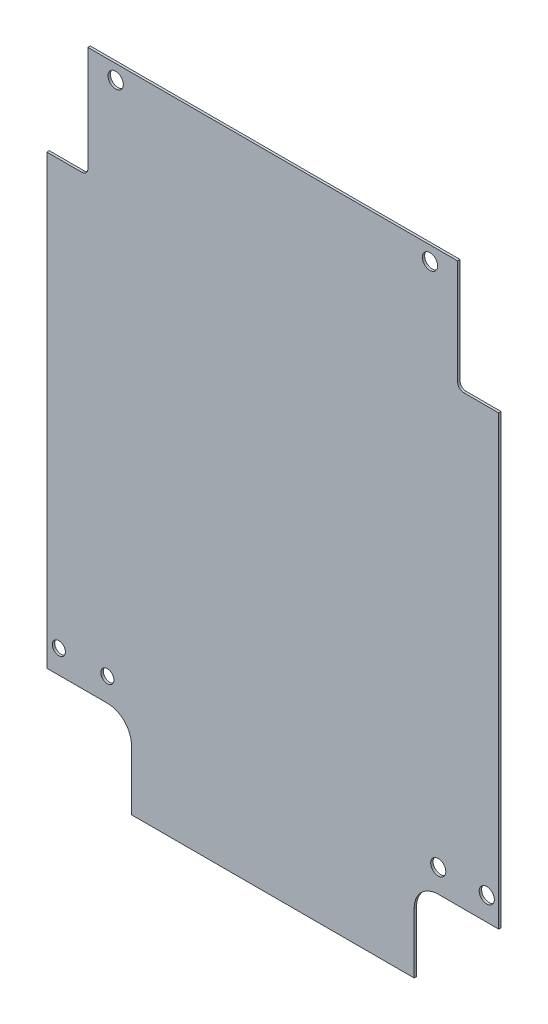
ISO-10303-21;
HEADER;
FILE_DESCRIPTION(('STEP AP214'),'2;1');
FILE_NAME('part.step','',(''),(''),'','','');
FILE_SCHEMA(('AUTOMOTIVE_DESIGN { 1 0 10303 214 1 1 1 1 }'));
ENDSEC;
DATA;
#1=APPLICATION_CONTEXT('core data for automotive mechanical design processes');
#2=APPLICATION_PROTOCOL_DEFINITION('international standard','automotive_design',2000,#1);
#3=PRODUCT_CONTEXT('',#1,'mechanical');
#4=PRODUCT('Part','Part','',(#3));
#5=PRODUCT_RELATED_PRODUCT_CATEGORY('part','',(#4));
#6=PRODUCT_DEFINITION_FORMATION('','',#4);
#7=PRODUCT_DEFINITION_CONTEXT('part definition',#1,'design');
#8=PRODUCT_DEFINITION('design','',#6,#7);
#9=PRODUCT_DEFINITION_SHAPE('','',#8);
#10=(LENGTH_UNIT() NAMED_UNIT(*) SI_UNIT(.MILLI.,.METRE.));
#11=(NAMED_UNIT(*) PLANE_ANGLE_UNIT() SI_UNIT($,.RADIAN.));
#12=(NAMED_UNIT(*) SI_UNIT($,.STERADIAN.) SOLID_ANGLE_UNIT());
#13=UNCERTAINTY_MEASURE_WITH_UNIT(LENGTH_MEASURE(1.E-05),#10,'distance_accuracy_value','');
#14=(GEOMETRIC_REPRESENTATION_CONTEXT(3) GLOBAL_UNCERTAINTY_ASSIGNED_CONTEXT((#13)) GLOBAL_UNIT_ASSIGNED_CONTEXT((#10,
#11,#12)) REPRESENTATION_CONTEXT('',''));
#15=CARTESIAN_POINT('',(0.,0.,0.));
#16=DIRECTION('',(0.,0.,1.));
#17=DIRECTION('',(1.,0.,0.));
#18=AXIS2_PLACEMENT_3D('',#15,#16,#17);
#19=CARTESIAN_POINT('',(79.022,-17.46,1.));
#20=DIRECTION('',(0.,0.,1.));
#21=DIRECTION('',(1.,0.,0.));
#22=AXIS2_PLACEMENT_3D('',#19,#20,#21);
#23=PLANE('',#22);
#24=CARTESIAN_POINT('',(88.5373476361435,-195.335160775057,1.));
#25=DIRECTION('',(0.,0.,1.));
#26=DIRECTION('',(1.,0.,0.));
#27=AXIS2_PLACEMENT_3D('',#24,#25,#26);
#28=CIRCLE('',#27,3.125);
#29=CARTESIAN_POINT('',(91.6623476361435,-195.335160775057,1.));
#30=VERTEX_POINT('',#29);
#31=EDGE_CURVE('E390',#30,#30,#28,.T.);
#32=ORIENTED_EDGE('',*,*,#31,.F.);
#33=EDGE_LOOP('',(#32));
#34=FACE_BOUND('',#33,.T.);
#35=CARTESIAN_POINT('',(-65.0266,20.0200000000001,1.));
#36=DIRECTION('',(0.,0.,1.));
#37=DIRECTION('',(1.,0.,0.));
#38=AXIS2_PLACEMENT_3D('',#35,#36,#37);
#39=CIRCLE('',#38,3.175);
#40=CARTESIAN_POINT('',(-61.8516,20.0200000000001,1.));
#41=VERTEX_POINT('',#40);
#42=EDGE_CURVE('E402',#41,#41,#39,.T.);
#43=ORIENTED_EDGE('',*,*,#42,.F.);
#44=EDGE_LOOP('',(#43));
#45=FACE_BOUND('',#44,.T.);
#46=CARTESIAN_POINT('',(-88.5373476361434,-195.335160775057,1.));
#47=DIRECTION('',(0.,0.,1.));
#48=DIRECTION('',(1.,0.,0.));
#49=AXIS2_PLACEMENT_3D('',#46,#47,#48);
#50=CIRCLE('',#49,2.7);
#51=CARTESIAN_POINT('',(-85.8373476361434,-195.335160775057,1.));
#52=VERTEX_POINT('',#51);
#53=EDGE_CURVE('E168',#52,#52,#50,.T.);
#54=ORIENTED_EDGE('',*,*,#53,.F.);
#55=EDGE_LOOP('',(#54));
#56=FACE_BOUND('',#55,.T.);
#57=CARTESIAN_POINT('',(79.022,-17.46,1.));
#58=DIRECTION('',(0.,0.,-1.));
#59=DIRECTION('',(1.,0.,0.));
#60=AXIS2_PLACEMENT_3D('',#57,#58,#59);
#61=CIRCLE('',#60,2.54000000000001);
#62=CARTESIAN_POINT('',(79.022,-20.,1.));
#63=VERTEX_POINT('',#62);
#64=CARTESIAN_POINT('',(76.482,-17.46,1.));
#65=VERTEX_POINT('',#64);
#66=EDGE_CURVE('E202',#63,#65,#61,.T.);
#67=ORIENTED_EDGE('',*,*,#66,.T.);
#68=DIRECTION('',(0.,1.,0.));
#69=VECTOR('',#68,1.);
#70=CARTESIAN_POINT('',(76.482,-17.46,1.));
#71=LINE('',#70,#69);
#72=CARTESIAN_POINT('',(76.482,26.,1.));
#73=VERTEX_POINT('',#72);
#74=EDGE_CURVE('E163',#65,#73,#71,.T.);
#75=ORIENTED_EDGE('',*,*,#74,.T.);
#76=DIRECTION('',(-1.,0.,0.));
#77=VECTOR('',#76,1.);
#78=CARTESIAN_POINT('',(76.482,26.,1.));
#79=LINE('',#78,#77);
#80=CARTESIAN_POINT('',(-76.5,26.,1.));
#81=VERTEX_POINT('',#80);
#82=EDGE_CURVE('E205',#73,#81,#79,.T.);
#83=ORIENTED_EDGE('',*,*,#82,.T.);
#84=DIRECTION('',(0.,-1.,0.));
#85=VECTOR('',#84,1.);
#86=CARTESIAN_POINT('',(-76.5,26.,1.));
#87=LINE('',#86,#85);
#88=CARTESIAN_POINT('',(-76.5,-17.46,1.));
#89=VERTEX_POINT('',#88);
#90=EDGE_CURVE('E207',#81,#89,#87,.T.);
#91=ORIENTED_EDGE('',*,*,#90,.T.);
#92=CARTESIAN_POINT('',(-79.04,-17.46,1.));
#93=DIRECTION('',(0.,0.,-1.));
#94=DIRECTION('',(1.,0.,0.));
#95=AXIS2_PLACEMENT_3D('',#92,#93,#94);
#96=CIRCLE('',#95,2.54);
#97=CARTESIAN_POINT('',(-79.04,-20.,1.));
#98=VERTEX_POINT('',#97);
#99=EDGE_CURVE('E209',#89,#98,#96,.T.);
#100=ORIENTED_EDGE('',*,*,#99,.T.);
#101=DIRECTION('',(-1.,0.,0.));
#102=VECTOR('',#101,1.);
#103=CARTESIAN_POINT('',(-79.04,-20.,1.));
#104=LINE('',#103,#102);
#105=CARTESIAN_POINT('',(-93.4999999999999,-20.,1.));
#106=VERTEX_POINT('',#105);
#107=EDGE_CURVE('E211',#98,#106,#104,.T.);
#108=ORIENTED_EDGE('',*,*,#107,.T.);
#109=DIRECTION('',(0.,-1.,0.));
#110=VECTOR('',#109,1.);
#111=CARTESIAN_POINT('',(-93.4999999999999,-20.,1.));
#112=LINE('',#111,#110);
#113=CARTESIAN_POINT('',(-93.4999999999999,-205.,1.));
#114=VERTEX_POINT('',#113);
#115=EDGE_CURVE('E213',#106,#114,#112,.T.);
#116=ORIENTED_EDGE('',*,*,#115,.T.);
#117=DIRECTION('',(1.,0.,0.));
#118=VECTOR('',#117,1.);
#119=CARTESIAN_POINT('',(-93.4999999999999,-205.,1.));
#120=LINE('',#119,#118);
#121=CARTESIAN_POINT('',(-68.4999999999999,-205.,1.));
#122=VERTEX_POINT('',#121);
#123=EDGE_CURVE('E215',#114,#122,#120,.T.);
#124=ORIENTED_EDGE('',*,*,#123,.T.);
#125=CARTESIAN_POINT('',(-68.4999999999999,-215.,1.));
#126=DIRECTION('',(0.,0.,-1.));
#127=DIRECTION('',(1.,0.,0.));
#128=AXIS2_PLACEMENT_3D('',#125,#126,#127);
#129=CIRCLE('',#128,10.);
#130=CARTESIAN_POINT('',(-58.4999999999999,-215.,1.));
#131=VERTEX_POINT('',#130);
#132=EDGE_CURVE('E217',#122,#131,#129,.T.);
#133=ORIENTED_EDGE('',*,*,#132,.T.);
#134=DIRECTION('',(0.,-1.,0.));
#135=VECTOR('',#134,1.);
#136=CARTESIAN_POINT('',(-58.4999999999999,-215.,1.));
#137=LINE('',#136,#135);
#138=CARTESIAN_POINT('',(-58.4999999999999,-240.,1.));
#139=VERTEX_POINT('',#138);
#140=EDGE_CURVE('E219',#131,#139,#137,.T.);
#141=ORIENTED_EDGE('',*,*,#140,.T.);
#142=DIRECTION('',(1.,0.,0.));
#143=VECTOR('',#142,1.);
#144=CARTESIAN_POINT('',(-58.4999999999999,-240.,1.));
#145=LINE('',#144,#143);
#146=CARTESIAN_POINT('',(58.5,-240.,1.));
#147=VERTEX_POINT('',#146);
#148=EDGE_CURVE('E221',#139,#147,#145,.T.);
#149=ORIENTED_EDGE('',*,*,#148,.T.);
#150=DIRECTION('',(0.,1.,0.));
#151=VECTOR('',#150,1.);
#152=CARTESIAN_POINT('',(58.5,-240.,1.));
#153=LINE('',#152,#151);
#154=CARTESIAN_POINT('',(58.5,-215.,1.));
#155=VERTEX_POINT('',#154);
#156=EDGE_CURVE('E223',#147,#155,#153,.T.);
#157=ORIENTED_EDGE('',*,*,#156,.T.);
#158=CARTESIAN_POINT('',(68.5,-215.,1.));
#159=DIRECTION('',(0.,0.,-1.));
#160=DIRECTION('',(1.,0.,0.));
#161=AXIS2_PLACEMENT_3D('',#158,#159,#160);
#162=CIRCLE('',#161,9.99999999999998);
#163=CARTESIAN_POINT('',(68.5,-205.,1.));
#164=VERTEX_POINT('',#163);
#165=EDGE_CURVE('E225',#155,#164,#162,.T.);
#166=ORIENTED_EDGE('',*,*,#165,.T.);
#167=DIRECTION('',(1.,0.,0.));
#168=VECTOR('',#167,1.);
#169=CARTESIAN_POINT('',(68.5,-205.,1.));
#170=LINE('',#169,#168);
#171=CARTESIAN_POINT('',(93.5,-205.,1.));
#172=VERTEX_POINT('',#171);
#173=EDGE_CURVE('E227',#164,#172,#170,.T.);
#174=ORIENTED_EDGE('',*,*,#173,.T.);
#175=DIRECTION('',(0.,1.,0.));
#176=VECTOR('',#175,1.);
#177=CARTESIAN_POINT('',(93.5,-205.,1.));
#178=LINE('',#177,#176);
#179=CARTESIAN_POINT('',(93.5,-20.,1.));
#180=VERTEX_POINT('',#179);
#181=EDGE_CURVE('E56',#172,#180,#178,.T.);
#182=ORIENTED_EDGE('',*,*,#181,.T.);
#183=DIRECTION('',(-1.,0.,0.));
#184=VECTOR('',#183,1.);
#185=CARTESIAN_POINT('',(93.5,-20.,1.));
#186=LINE('',#185,#184);
#187=EDGE_CURVE('E51',#180,#63,#186,.T.);
#188=ORIENTED_EDGE('',*,*,#187,.T.);
#189=EDGE_LOOP('',(#67,#75,#83,#91,#100,#108,#116,#124,#133,#141,#149,#157,#166,#174,#182,#188));
#190=FACE_BOUND('',#189,.T.);
#191=CARTESIAN_POINT('',(-68.4621723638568,-195.335160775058,1.));
#192=DIRECTION('',(0.,0.,1.));
#193=DIRECTION('',(1.,0.,0.));
#194=AXIS2_PLACEMENT_3D('',#191,#192,#193);
#195=CIRCLE('',#194,2.7);
#196=CARTESIAN_POINT('',(-65.7621723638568,-195.335160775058,1.));
#197=VERTEX_POINT('',#196);
#198=EDGE_CURVE('E408',#197,#197,#195,.T.);
#199=ORIENTED_EDGE('',*,*,#198,.F.);
#200=EDGE_LOOP('',(#199));
#201=FACE_BOUND('',#200,.T.);
#202=CARTESIAN_POINT('',(65.0266,20.0200000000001,1.));
#203=DIRECTION('',(0.,0.,1.));
#204=DIRECTION('',(1.,0.,0.));
#205=AXIS2_PLACEMENT_3D('',#202,#203,#204);
#206=CIRCLE('',#205,3.175);
#207=CARTESIAN_POINT('',(68.2016,20.0200000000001,1.));
#208=VERTEX_POINT('',#207);
#209=EDGE_CURVE('E396',#208,#208,#206,.T.);
#210=ORIENTED_EDGE('',*,*,#209,.F.);
#211=EDGE_LOOP('',(#210));
#212=FACE_BOUND('',#211,.T.);
#213=CARTESIAN_POINT('',(68.4621723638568,-195.335160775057,1.));
#214=DIRECTION('',(0.,0.,1.));
#215=DIRECTION('',(1.,0.,0.));
#216=AXIS2_PLACEMENT_3D('',#213,#214,#215);
#217=CIRCLE('',#216,3.125);
#218=CARTESIAN_POINT('',(71.5871723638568,-195.335160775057,1.));
#219=VERTEX_POINT('',#218);
#220=EDGE_CURVE('E379',#219,#219,#217,.T.);
#221=ORIENTED_EDGE('',*,*,#220,.F.);
#222=EDGE_LOOP('',(#221));
#223=FACE_BOUND('',#222,.T.);
#224=ADVANCED_FACE('F36',(#34,#45,#56,#190,#201,#212,#223),#23,.T.);
#225=CARTESIAN_POINT('',(79.022,-17.46,0.));
#226=DIRECTION('',(0.,0.,1.));
#227=DIRECTION('',(1.,0.,0.));
#228=AXIS2_PLACEMENT_3D('',#225,#226,#227);
#229=PLANE('',#228);
#230=CARTESIAN_POINT('',(88.5373476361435,-195.335160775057,0.));
#231=DIRECTION('',(0.,0.,1.));
#232=DIRECTION('',(1.,0.,0.));
#233=AXIS2_PLACEMENT_3D('',#230,#231,#232);
#234=CIRCLE('',#233,3.125);
#235=CARTESIAN_POINT('',(91.6623476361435,-195.335160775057,0.));
#236=VERTEX_POINT('',#235);
#237=EDGE_CURVE('E385',#236,#236,#234,.T.);
#238=ORIENTED_EDGE('',*,*,#237,.T.);
#239=EDGE_LOOP('',(#238));
#240=FACE_BOUND('',#239,.T.);
#241=CARTESIAN_POINT('',(-65.0266,20.0200000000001,0.));
#242=DIRECTION('',(0.,0.,1.));
#243=DIRECTION('',(1.,0.,0.));
#244=AXIS2_PLACEMENT_3D('',#241,#242,#243);
#245=CIRCLE('',#244,3.175);
#246=CARTESIAN_POINT('',(-61.8516,20.0200000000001,0.));
#247=VERTEX_POINT('',#246);
#248=EDGE_CURVE('E399',#247,#247,#245,.T.);
#249=ORIENTED_EDGE('',*,*,#248,.T.);
#250=EDGE_LOOP('',(#249));
#251=FACE_BOUND('',#250,.T.);
#252=CARTESIAN_POINT('',(-88.5373476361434,-195.335160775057,0.));
#253=DIRECTION('',(0.,0.,1.));
#254=DIRECTION('',(1.,0.,0.));
#255=AXIS2_PLACEMENT_3D('',#252,#253,#254);
#256=CIRCLE('',#255,2.7);
#257=CARTESIAN_POINT('',(-85.8373476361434,-195.335160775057,0.));
#258=VERTEX_POINT('',#257);
#259=EDGE_CURVE('E171',#258,#258,#256,.T.);
#260=ORIENTED_EDGE('',*,*,#259,.T.);
#261=EDGE_LOOP('',(#260));
#262=FACE_BOUND('',#261,.T.);
#263=CARTESIAN_POINT('',(79.022,-17.46,0.));
#264=DIRECTION('',(0.,0.,-1.));
#265=DIRECTION('',(1.,0.,0.));
#266=AXIS2_PLACEMENT_3D('',#263,#264,#265);
#267=CIRCLE('',#266,2.54000000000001);
#268=CARTESIAN_POINT('',(79.022,-20.,0.));
#269=VERTEX_POINT('',#268);
#270=CARTESIAN_POINT('',(76.482,-17.46,0.));
#271=VERTEX_POINT('',#270);
#272=EDGE_CURVE('E154',#269,#271,#267,.T.);
#273=ORIENTED_EDGE('',*,*,#272,.F.);
#274=DIRECTION('',(-1.,0.,0.));
#275=VECTOR('',#274,1.);
#276=CARTESIAN_POINT('',(93.5,-20.,0.));
#277=LINE('',#276,#275);
#278=CARTESIAN_POINT('',(93.5,-20.,0.));
#279=VERTEX_POINT('',#278);
#280=EDGE_CURVE('E200',#279,#269,#277,.T.);
#281=ORIENTED_EDGE('',*,*,#280,.F.);
#282=DIRECTION('',(0.,1.,0.));
#283=VECTOR('',#282,1.);
#284=CARTESIAN_POINT('',(93.5,-205.,0.));
#285=LINE('',#284,#283);
#286=CARTESIAN_POINT('',(93.5,-205.,0.));
#287=VERTEX_POINT('',#286);
#288=EDGE_CURVE('E198',#287,#279,#285,.T.);
#289=ORIENTED_EDGE('',*,*,#288,.F.);
#290=DIRECTION('',(1.,0.,0.));
#291=VECTOR('',#290,1.);
#292=CARTESIAN_POINT('',(68.5,-205.,0.));
#293=LINE('',#292,#291);
#294=CARTESIAN_POINT('',(68.5,-205.,0.));
#295=VERTEX_POINT('',#294);
#296=EDGE_CURVE('E196',#295,#287,#293,.T.);
#297=ORIENTED_EDGE('',*,*,#296,.F.);
#298=CARTESIAN_POINT('',(68.5,-215.,0.));
#299=DIRECTION('',(0.,0.,-1.));
#300=DIRECTION('',(1.,0.,0.));
#301=AXIS2_PLACEMENT_3D('',#298,#299,#300);
#302=CIRCLE('',#301,9.99999999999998);
#303=CARTESIAN_POINT('',(58.5,-215.,0.));
#304=VERTEX_POINT('',#303);
#305=EDGE_CURVE('E194',#304,#295,#302,.T.);
#306=ORIENTED_EDGE('',*,*,#305,.F.);
#307=DIRECTION('',(0.,1.,0.));
#308=VECTOR('',#307,1.);
#309=CARTESIAN_POINT('',(58.5,-240.,0.));
#310=LINE('',#309,#308);
#311=CARTESIAN_POINT('',(58.5,-240.,0.));
#312=VERTEX_POINT('',#311);
#313=EDGE_CURVE('E192',#312,#304,#310,.T.);
#314=ORIENTED_EDGE('',*,*,#313,.F.);
#315=DIRECTION('',(1.,0.,0.));
#316=VECTOR('',#315,1.);
#317=CARTESIAN_POINT('',(-58.4999999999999,-240.,0.));
#318=LINE('',#317,#316);
#319=CARTESIAN_POINT('',(-58.4999999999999,-240.,0.));
#320=VERTEX_POINT('',#319);
#321=EDGE_CURVE('E190',#320,#312,#318,.T.);
#322=ORIENTED_EDGE('',*,*,#321,.F.);
#323=DIRECTION('',(0.,-1.,0.));
#324=VECTOR('',#323,1.);
#325=CARTESIAN_POINT('',(-58.4999999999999,-215.,0.));
#326=LINE('',#325,#324);
#327=CARTESIAN_POINT('',(-58.4999999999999,-215.,0.));
#328=VERTEX_POINT('',#327);
#329=EDGE_CURVE('E188',#328,#320,#326,.T.);
#330=ORIENTED_EDGE('',*,*,#329,.F.);
#331=CARTESIAN_POINT('',(-68.4999999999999,-215.,0.));
#332=DIRECTION('',(0.,0.,-1.));
#333=DIRECTION('',(1.,0.,0.));
#334=AXIS2_PLACEMENT_3D('',#331,#332,#333);
#335=CIRCLE('',#334,10.);
#336=CARTESIAN_POINT('',(-68.4999999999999,-205.,0.));
#337=VERTEX_POINT('',#336);
#338=EDGE_CURVE('E186',#337,#328,#335,.T.);
#339=ORIENTED_EDGE('',*,*,#338,.F.);
#340=DIRECTION('',(1.,0.,0.));
#341=VECTOR('',#340,1.);
#342=CARTESIAN_POINT('',(-93.4999999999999,-205.,0.));
#343=LINE('',#342,#341);
#344=CARTESIAN_POINT('',(-93.4999999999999,-205.,0.));
#345=VERTEX_POINT('',#344);
#346=EDGE_CURVE('E184',#345,#337,#343,.T.);
#347=ORIENTED_EDGE('',*,*,#346,.F.);
#348=DIRECTION('',(0.,-1.,0.));
#349=VECTOR('',#348,1.);
#350=CARTESIAN_POINT('',(-93.4999999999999,-20.,0.));
#351=LINE('',#350,#349);
#352=CARTESIAN_POINT('',(-93.4999999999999,-20.,0.));
#353=VERTEX_POINT('',#352);
#354=EDGE_CURVE('E182',#353,#345,#351,.T.);
#355=ORIENTED_EDGE('',*,*,#354,.F.);
#356=DIRECTION('',(-1.,0.,0.));
#357=VECTOR('',#356,1.);
#358=CARTESIAN_POINT('',(-79.04,-20.,0.));
#359=LINE('',#358,#357);
#360=CARTESIAN_POINT('',(-79.04,-20.,0.));
#361=VERTEX_POINT('',#360);
#362=EDGE_CURVE('E180',#361,#353,#359,.T.);
#363=ORIENTED_EDGE('',*,*,#362,.F.);
#364=CARTESIAN_POINT('',(-79.04,-17.46,0.));
#365=DIRECTION('',(0.,0.,-1.));
#366=DIRECTION('',(1.,0.,0.));
#367=AXIS2_PLACEMENT_3D('',#364,#365,#366);
#368=CIRCLE('',#367,2.54);
#369=CARTESIAN_POINT('',(-76.5,-17.46,0.));
#370=VERTEX_POINT('',#369);
#371=EDGE_CURVE('E178',#370,#361,#368,.T.);
#372=ORIENTED_EDGE('',*,*,#371,.F.);
#373=DIRECTION('',(0.,-1.,0.));
#374=VECTOR('',#373,1.);
#375=CARTESIAN_POINT('',(-76.5,26.,0.));
#376=LINE('',#375,#374);
#377=CARTESIAN_POINT('',(-76.5,26.,0.));
#378=VERTEX_POINT('',#377);
#379=EDGE_CURVE('E176',#378,#370,#376,.T.);
#380=ORIENTED_EDGE('',*,*,#379,.F.);
#381=DIRECTION('',(-1.,0.,0.));
#382=VECTOR('',#381,1.);
#383=CARTESIAN_POINT('',(76.482,26.,0.));
#384=LINE('',#383,#382);
#385=CARTESIAN_POINT('',(76.482,26.,0.));
#386=VERTEX_POINT('',#385);
#387=EDGE_CURVE('E156',#386,#378,#384,.T.);
#388=ORIENTED_EDGE('',*,*,#387,.F.);
#389=DIRECTION('',(0.,1.,0.));
#390=VECTOR('',#389,1.);
#391=CARTESIAN_POINT('',(76.482,-17.46,0.));
#392=LINE('',#391,#390);
#393=EDGE_CURVE('E149',#271,#386,#392,.T.);
#394=ORIENTED_EDGE('',*,*,#393,.F.);
#395=EDGE_LOOP('',(#273,#281,#289,#297,#306,#314,#322,#330,#339,#347,#355,#363,#372,#380,#388,#394));
#396=FACE_BOUND('',#395,.T.);
#397=CARTESIAN_POINT('',(-68.4621723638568,-195.335160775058,0.));
#398=DIRECTION('',(0.,0.,1.));
#399=DIRECTION('',(1.,0.,0.));
#400=AXIS2_PLACEMENT_3D('',#397,#398,#399);
#401=CIRCLE('',#400,2.7);
#402=CARTESIAN_POINT('',(-65.7621723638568,-195.335160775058,0.));
#403=VERTEX_POINT('',#402);
#404=EDGE_CURVE('E405',#403,#403,#401,.T.);
#405=ORIENTED_EDGE('',*,*,#404,.T.);
#406=EDGE_LOOP('',(#405));
#407=FACE_BOUND('',#406,.T.);
#408=CARTESIAN_POINT('',(65.0266,20.0200000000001,0.));
#409=DIRECTION('',(0.,0.,1.));
#410=DIRECTION('',(1.,0.,0.));
#411=AXIS2_PLACEMENT_3D('',#408,#409,#410);
#412=CIRCLE('',#411,3.175);
#413=CARTESIAN_POINT('',(68.2016,20.0200000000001,0.));
#414=VERTEX_POINT('',#413);
#415=EDGE_CURVE('E393',#414,#414,#412,.T.);
#416=ORIENTED_EDGE('',*,*,#415,.T.);
#417=EDGE_LOOP('',(#416));
#418=FACE_BOUND('',#417,.T.);
#419=CARTESIAN_POINT('',(68.4621723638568,-195.335160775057,0.));
#420=DIRECTION('',(0.,0.,1.));
#421=DIRECTION('',(1.,0.,0.));
#422=AXIS2_PLACEMENT_3D('',#419,#420,#421);
#423=CIRCLE('',#422,3.125);
#424=CARTESIAN_POINT('',(71.5871723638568,-195.335160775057,0.));
#425=VERTEX_POINT('',#424);
#426=EDGE_CURVE('E382',#425,#425,#423,.T.);
#427=ORIENTED_EDGE('',*,*,#426,.T.);
#428=EDGE_LOOP('',(#427));
#429=FACE_BOUND('',#428,.T.);
#430=ADVANCED_FACE('F150',(#240,#251,#262,#396,#407,#418,#429),#229,.F.);
#431=CARTESIAN_POINT('',(79.022,-17.46,1.));
#432=DIRECTION('',(0.,0.,-1.));
#433=DIRECTION('',(-1.,0.,0.));
#434=AXIS2_PLACEMENT_3D('',#431,#432,#433);
#435=CYLINDRICAL_SURFACE('',#434,2.54000000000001);
#436=ORIENTED_EDGE('',*,*,#272,.T.);
#437=DIRECTION('',(0.,0.,-1.));
#438=VECTOR('',#437,1.);
#439=CARTESIAN_POINT('',(76.482,-17.46,1.));
#440=LINE('',#439,#438);
#441=EDGE_CURVE('E11',#65,#271,#440,.T.);
#442=ORIENTED_EDGE('',*,*,#441,.F.);
#443=ORIENTED_EDGE('',*,*,#66,.F.);
#444=DIRECTION('',(0.,0.,-1.));
#445=VECTOR('',#444,1.);
#446=CARTESIAN_POINT('',(79.022,-20.,1.));
#447=LINE('',#446,#445);
#448=EDGE_CURVE('E167',#63,#269,#447,.T.);
#449=ORIENTED_EDGE('',*,*,#448,.T.);
#450=EDGE_LOOP('',(#436,#442,#443,#449));
#451=FACE_BOUND('',#450,.T.);
#452=ADVANCED_FACE('F38',(#451),#435,.F.);
#453=CARTESIAN_POINT('',(76.482,-17.46,1.));
#454=DIRECTION('',(-1.,0.,0.));
#455=DIRECTION('',(0.,-1.,0.));
#456=AXIS2_PLACEMENT_3D('',#453,#454,#455);
#457=PLANE('',#456);
#458=ORIENTED_EDGE('',*,*,#393,.T.);
#459=DIRECTION('',(0.,0.,-1.));
#460=VECTOR('',#459,1.);
#461=CARTESIAN_POINT('',(76.482,26.,1.));
#462=LINE('',#461,#460);
#463=EDGE_CURVE('E44',#73,#386,#462,.T.);
#464=ORIENTED_EDGE('',*,*,#463,.F.);
#465=ORIENTED_EDGE('',*,*,#74,.F.);
#466=ORIENTED_EDGE('',*,*,#441,.T.);
#467=EDGE_LOOP('',(#458,#464,#465,#466));
#468=FACE_BOUND('',#467,.T.);
#469=ADVANCED_FACE('F162',(#468),#457,.F.);
#470=CARTESIAN_POINT('',(76.482,26.,1.));
#471=DIRECTION('',(0.,-1.,0.));
#472=DIRECTION('',(1.,0.,0.));
#473=AXIS2_PLACEMENT_3D('',#470,#471,#472);
#474=PLANE('',#473);
#475=ORIENTED_EDGE('',*,*,#387,.T.);
#476=DIRECTION('',(0.,0.,-1.));
#477=VECTOR('',#476,1.);
#478=CARTESIAN_POINT('',(-76.5,26.,1.));
#479=LINE('',#478,#477);
#480=EDGE_CURVE('E268',#81,#378,#479,.T.);
#481=ORIENTED_EDGE('',*,*,#480,.F.);
#482=ORIENTED_EDGE('',*,*,#82,.F.);
#483=ORIENTED_EDGE('',*,*,#463,.T.);
#484=EDGE_LOOP('',(#475,#481,#482,#483));
#485=FACE_BOUND('',#484,.T.);
#486=ADVANCED_FACE('F272',(#485),#474,.F.);
#487=CARTESIAN_POINT('',(-76.5,26.,1.));
#488=DIRECTION('',(1.,0.,0.));
#489=DIRECTION('',(0.,0.,-1.));
#490=AXIS2_PLACEMENT_3D('',#487,#488,#489);
#491=PLANE('',#490);
#492=ORIENTED_EDGE('',*,*,#379,.T.);
#493=DIRECTION('',(0.,0.,-1.));
#494=VECTOR('',#493,1.);
#495=CARTESIAN_POINT('',(-76.5,-17.46,1.));
#496=LINE('',#495,#494);
#497=EDGE_CURVE('E265',#89,#370,#496,.T.);
#498=ORIENTED_EDGE('',*,*,#497,.F.);
#499=ORIENTED_EDGE('',*,*,#90,.F.);
#500=ORIENTED_EDGE('',*,*,#480,.T.);
#501=EDGE_LOOP('',(#492,#498,#499,#500));
#502=FACE_BOUND('',#501,.T.);
#503=ADVANCED_FACE('F280',(#502),#491,.F.);
#504=CARTESIAN_POINT('',(-79.04,-17.46,1.));
#505=DIRECTION('',(0.,0.,-1.));
#506=DIRECTION('',(-1.,0.,0.));
#507=AXIS2_PLACEMENT_3D('',#504,#505,#506);
#508=CYLINDRICAL_SURFACE('',#507,2.54);
#509=ORIENTED_EDGE('',*,*,#371,.T.);
#510=DIRECTION('',(0.,0.,-1.));
#511=VECTOR('',#510,1.);
#512=CARTESIAN_POINT('',(-79.04,-20.,1.));
#513=LINE('',#512,#511);
#514=EDGE_CURVE('E262',#98,#361,#513,.T.);
#515=ORIENTED_EDGE('',*,*,#514,.F.);
#516=ORIENTED_EDGE('',*,*,#99,.F.);
#517=ORIENTED_EDGE('',*,*,#497,.T.);
#518=EDGE_LOOP('',(#509,#515,#516,#517));
#519=FACE_BOUND('',#518,.T.);
#520=ADVANCED_FACE('F283',(#519),#508,.F.);
#521=CARTESIAN_POINT('',(-79.04,-20.,1.));
#522=DIRECTION('',(0.,-1.,0.));
#523=DIRECTION('',(1.,0.,0.));
#524=AXIS2_PLACEMENT_3D('',#521,#522,#523);
#525=PLANE('',#524);
#526=ORIENTED_EDGE('',*,*,#362,.T.);
#527=DIRECTION('',(0.,0.,-1.));
#528=VECTOR('',#527,1.);
#529=CARTESIAN_POINT('',(-93.4999999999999,-20.,1.));
#530=LINE('',#529,#528);
#531=EDGE_CURVE('E259',#106,#353,#530,.T.);
#532=ORIENTED_EDGE('',*,*,#531,.F.);
#533=ORIENTED_EDGE('',*,*,#107,.F.);
#534=ORIENTED_EDGE('',*,*,#514,.T.);
#535=EDGE_LOOP('',(#526,#532,#533,#534));
#536=FACE_BOUND('',#535,.T.);
#537=ADVANCED_FACE('F288',(#536),#525,.F.);
#538=CARTESIAN_POINT('',(-93.4999999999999,-20.,1.));
#539=DIRECTION('',(1.,0.,0.));
#540=DIRECTION('',(0.,0.,-1.));
#541=AXIS2_PLACEMENT_3D('',#538,#539,#540);
#542=PLANE('',#541);
#543=ORIENTED_EDGE('',*,*,#354,.T.);
#544=DIRECTION('',(0.,0.,-1.));
#545=VECTOR('',#544,1.);
#546=CARTESIAN_POINT('',(-93.4999999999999,-205.,1.));
#547=LINE('',#546,#545);
#548=EDGE_CURVE('E256',#114,#345,#547,.T.);
#549=ORIENTED_EDGE('',*,*,#548,.F.);
#550=ORIENTED_EDGE('',*,*,#115,.F.);
#551=ORIENTED_EDGE('',*,*,#531,.T.);
#552=EDGE_LOOP('',(#543,#549,#550,#551));
#553=FACE_BOUND('',#552,.T.);
#554=ADVANCED_FACE('F294',(#553),#542,.F.);
#555=CARTESIAN_POINT('',(-93.4999999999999,-205.,1.));
#556=DIRECTION('',(0.,1.,0.));
#557=DIRECTION('',(-1.,0.,0.));
#558=AXIS2_PLACEMENT_3D('',#555,#556,#557);
#559=PLANE('',#558);
#560=ORIENTED_EDGE('',*,*,#346,.T.);
#561=DIRECTION('',(0.,0.,-1.));
#562=VECTOR('',#561,1.);
#563=CARTESIAN_POINT('',(-68.4999999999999,-205.,1.));
#564=LINE('',#563,#562);
#565=EDGE_CURVE('E253',#122,#337,#564,.T.);
#566=ORIENTED_EDGE('',*,*,#565,.F.);
#567=ORIENTED_EDGE('',*,*,#123,.F.);
#568=ORIENTED_EDGE('',*,*,#548,.T.);
#569=EDGE_LOOP('',(#560,#566,#567,#568));
#570=FACE_BOUND('',#569,.T.);
#571=ADVANCED_FACE('F298',(#570),#559,.F.);
#572=CARTESIAN_POINT('',(-68.4999999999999,-215.,1.));
#573=DIRECTION('',(0.,0.,-1.));
#574=DIRECTION('',(-1.,0.,0.));
#575=AXIS2_PLACEMENT_3D('',#572,#573,#574);
#576=CYLINDRICAL_SURFACE('',#575,10.);
#577=ORIENTED_EDGE('',*,*,#338,.T.);
#578=DIRECTION('',(0.,0.,-1.));
#579=VECTOR('',#578,1.);
#580=CARTESIAN_POINT('',(-58.4999999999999,-215.,1.));
#581=LINE('',#580,#579);
#582=EDGE_CURVE('E250',#131,#328,#581,.T.);
#583=ORIENTED_EDGE('',*,*,#582,.F.);
#584=ORIENTED_EDGE('',*,*,#132,.F.);
#585=ORIENTED_EDGE('',*,*,#565,.T.);
#586=EDGE_LOOP('',(#577,#583,#584,#585));
#587=FACE_BOUND('',#586,.T.);
#588=ADVANCED_FACE('F303',(#587),#576,.F.);
#589=CARTESIAN_POINT('',(-58.4999999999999,-215.,1.));
#590=DIRECTION('',(1.,0.,0.));
#591=DIRECTION('',(0.,1.,0.));
#592=AXIS2_PLACEMENT_3D('',#589,#590,#591);
#593=PLANE('',#592);
#594=ORIENTED_EDGE('',*,*,#329,.T.);
#595=DIRECTION('',(0.,0.,-1.));
#596=VECTOR('',#595,1.);
#597=CARTESIAN_POINT('',(-58.4999999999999,-240.,1.));
#598=LINE('',#597,#596);
#599=EDGE_CURVE('E247',#139,#320,#598,.T.);
#600=ORIENTED_EDGE('',*,*,#599,.F.);
#601=ORIENTED_EDGE('',*,*,#140,.F.);
#602=ORIENTED_EDGE('',*,*,#582,.T.);
#603=EDGE_LOOP('',(#594,#600,#601,#602));
#604=FACE_BOUND('',#603,.T.);
#605=ADVANCED_FACE('F309',(#604),#593,.F.);
#606=CARTESIAN_POINT('',(-58.4999999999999,-240.,1.));
#607=DIRECTION('',(0.,1.,0.));
#608=DIRECTION('',(-1.,0.,0.));
#609=AXIS2_PLACEMENT_3D('',#606,#607,#608);
#610=PLANE('',#609);
#611=ORIENTED_EDGE('',*,*,#321,.T.);
#612=DIRECTION('',(0.,0.,-1.));
#613=VECTOR('',#612,1.);
#614=CARTESIAN_POINT('',(58.5,-240.,1.));
#615=LINE('',#614,#613);
#616=EDGE_CURVE('E244',#147,#312,#615,.T.);
#617=ORIENTED_EDGE('',*,*,#616,.F.);
#618=ORIENTED_EDGE('',*,*,#148,.F.);
#619=ORIENTED_EDGE('',*,*,#599,.T.);
#620=EDGE_LOOP('',(#611,#617,#618,#619));
#621=FACE_BOUND('',#620,.T.);
#622=ADVANCED_FACE('F313',(#621),#610,.F.);
#623=CARTESIAN_POINT('',(58.5,-240.,1.));
#624=DIRECTION('',(-1.,0.,0.));
#625=DIRECTION('',(0.,-1.,0.));
#626=AXIS2_PLACEMENT_3D('',#623,#624,#625);
#627=PLANE('',#626);
#628=ORIENTED_EDGE('',*,*,#313,.T.);
#629=DIRECTION('',(0.,0.,-1.));
#630=VECTOR('',#629,1.);
#631=CARTESIAN_POINT('',(58.5,-215.,1.));
#632=LINE('',#631,#630);
#633=EDGE_CURVE('E241',#155,#304,#632,.T.);
#634=ORIENTED_EDGE('',*,*,#633,.F.);
#635=ORIENTED_EDGE('',*,*,#156,.F.);
#636=ORIENTED_EDGE('',*,*,#616,.T.);
#637=EDGE_LOOP('',(#628,#634,#635,#636));
#638=FACE_BOUND('',#637,.T.);
#639=ADVANCED_FACE('F318',(#638),#627,.F.);
#640=CARTESIAN_POINT('',(68.5,-215.,1.));
#641=DIRECTION('',(0.,0.,-1.));
#642=DIRECTION('',(-1.,0.,0.));
#643=AXIS2_PLACEMENT_3D('',#640,#641,#642);
#644=CYLINDRICAL_SURFACE('',#643,9.99999999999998);
#645=ORIENTED_EDGE('',*,*,#305,.T.);
#646=DIRECTION('',(0.,0.,-1.));
#647=VECTOR('',#646,1.);
#648=CARTESIAN_POINT('',(68.5,-205.,1.));
#649=LINE('',#648,#647);
#650=EDGE_CURVE('E238',#164,#295,#649,.T.);
#651=ORIENTED_EDGE('',*,*,#650,.F.);
#652=ORIENTED_EDGE('',*,*,#165,.F.);
#653=ORIENTED_EDGE('',*,*,#633,.T.);
#654=EDGE_LOOP('',(#645,#651,#652,#653));
#655=FACE_BOUND('',#654,.T.);
#656=ADVANCED_FACE('F324',(#655),#644,.F.);
#657=CARTESIAN_POINT('',(68.5,-205.,1.));
#658=DIRECTION('',(0.,1.,0.));
#659=DIRECTION('',(-1.,0.,0.));
#660=AXIS2_PLACEMENT_3D('',#657,#658,#659);
#661=PLANE('',#660);
#662=ORIENTED_EDGE('',*,*,#296,.T.);
#663=DIRECTION('',(0.,0.,-1.));
#664=VECTOR('',#663,1.);
#665=CARTESIAN_POINT('',(93.5,-205.,1.));
#666=LINE('',#665,#664);
#667=EDGE_CURVE('E235',#172,#287,#666,.T.);
#668=ORIENTED_EDGE('',*,*,#667,.F.);
#669=ORIENTED_EDGE('',*,*,#173,.F.);
#670=ORIENTED_EDGE('',*,*,#650,.T.);
#671=EDGE_LOOP('',(#662,#668,#669,#670));
#672=FACE_BOUND('',#671,.T.);
#673=ADVANCED_FACE('F328',(#672),#661,.F.);
#674=CARTESIAN_POINT('',(93.5,-205.,1.));
#675=DIRECTION('',(-1.,0.,0.));
#676=DIRECTION('',(0.,-1.,0.));
#677=AXIS2_PLACEMENT_3D('',#674,#675,#676);
#678=PLANE('',#677);
#679=ORIENTED_EDGE('',*,*,#288,.T.);
#680=DIRECTION('',(0.,0.,-1.));
#681=VECTOR('',#680,1.);
#682=CARTESIAN_POINT('',(93.5,-20.,1.));
#683=LINE('',#682,#681);
#684=EDGE_CURVE('E232',#180,#279,#683,.T.);
#685=ORIENTED_EDGE('',*,*,#684,.F.);
#686=ORIENTED_EDGE('',*,*,#181,.F.);
#687=ORIENTED_EDGE('',*,*,#667,.T.);
#688=EDGE_LOOP('',(#679,#685,#686,#687));
#689=FACE_BOUND('',#688,.T.);
#690=ADVANCED_FACE('F331',(#689),#678,.F.);
#691=CARTESIAN_POINT('',(93.5,-20.,1.));
#692=DIRECTION('',(0.,-1.,0.));
#693=DIRECTION('',(0.,0.,-1.));
#694=AXIS2_PLACEMENT_3D('',#691,#692,#693);
#695=PLANE('',#694);
#696=ORIENTED_EDGE('',*,*,#280,.T.);
#697=ORIENTED_EDGE('',*,*,#448,.F.);
#698=ORIENTED_EDGE('',*,*,#187,.F.);
#699=ORIENTED_EDGE('',*,*,#684,.T.);
#700=EDGE_LOOP('',(#696,#697,#698,#699));
#701=FACE_BOUND('',#700,.T.);
#702=ADVANCED_FACE('F333',(#701),#695,.F.);
#703=CARTESIAN_POINT('',(-88.5373476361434,-195.335160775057,1.));
#704=DIRECTION('',(0.,0.,-1.));
#705=DIRECTION('',(-1.,0.,0.));
#706=AXIS2_PLACEMENT_3D('',#703,#704,#705);
#707=CYLINDRICAL_SURFACE('',#706,2.7);
#708=ORIENTED_EDGE('',*,*,#53,.T.);
#709=EDGE_LOOP('',(#708));
#710=FACE_BOUND('',#709,.T.);
#711=ORIENTED_EDGE('',*,*,#259,.F.);
#712=EDGE_LOOP('',(#711));
#713=FACE_BOUND('',#712,.T.);
#714=ADVANCED_FACE('F335',(#710,#713),#707,.F.);
#715=CARTESIAN_POINT('',(-68.4621723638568,-195.335160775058,1.));
#716=DIRECTION('',(0.,0.,-1.));
#717=DIRECTION('',(-1.,0.,0.));
#718=AXIS2_PLACEMENT_3D('',#715,#716,#717);
#719=CYLINDRICAL_SURFACE('',#718,2.7);
#720=ORIENTED_EDGE('',*,*,#198,.T.);
#721=EDGE_LOOP('',(#720));
#722=FACE_BOUND('',#721,.T.);
#723=ORIENTED_EDGE('',*,*,#404,.F.);
#724=EDGE_LOOP('',(#723));
#725=FACE_BOUND('',#724,.T.);
#726=ADVANCED_FACE('F341',(#722,#725),#719,.F.);
#727=CARTESIAN_POINT('',(-65.0266,20.0200000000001,1.));
#728=DIRECTION('',(0.,0.,-1.));
#729=DIRECTION('',(-1.,0.,0.));
#730=AXIS2_PLACEMENT_3D('',#727,#728,#729);
#731=CYLINDRICAL_SURFACE('',#730,3.175);
#732=ORIENTED_EDGE('',*,*,#42,.T.);
#733=EDGE_LOOP('',(#732));
#734=FACE_BOUND('',#733,.T.);
#735=ORIENTED_EDGE('',*,*,#248,.F.);
#736=EDGE_LOOP('',(#735));
#737=FACE_BOUND('',#736,.T.);
#738=ADVANCED_FACE('F358',(#734,#737),#731,.F.);
#739=CARTESIAN_POINT('',(65.0266,20.0200000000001,1.));
#740=DIRECTION('',(0.,0.,-1.));
#741=DIRECTION('',(-1.,0.,0.));
#742=AXIS2_PLACEMENT_3D('',#739,#740,#741);
#743=CYLINDRICAL_SURFACE('',#742,3.175);
#744=ORIENTED_EDGE('',*,*,#209,.T.);
#745=EDGE_LOOP('',(#744));
#746=FACE_BOUND('',#745,.T.);
#747=ORIENTED_EDGE('',*,*,#415,.F.);
#748=EDGE_LOOP('',(#747));
#749=FACE_BOUND('',#748,.T.);
#750=ADVANCED_FACE('F362',(#746,#749),#743,.F.);
#751=CARTESIAN_POINT('',(88.5373476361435,-195.335160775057,1.));
#752=DIRECTION('',(0.,0.,-1.));
#753=DIRECTION('',(-1.,0.,0.));
#754=AXIS2_PLACEMENT_3D('',#751,#752,#753);
#755=CYLINDRICAL_SURFACE('',#754,3.125);
#756=ORIENTED_EDGE('',*,*,#31,.T.);
#757=EDGE_LOOP('',(#756));
#758=FACE_BOUND('',#757,.T.);
#759=ORIENTED_EDGE('',*,*,#237,.F.);
#760=EDGE_LOOP('',(#759));
#761=FACE_BOUND('',#760,.T.);
#762=ADVANCED_FACE('F366',(#758,#761),#755,.F.);
#763=CARTESIAN_POINT('',(68.4621723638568,-195.335160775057,1.));
#764=DIRECTION('',(0.,0.,-1.));
#765=DIRECTION('',(-1.,0.,0.));
#766=AXIS2_PLACEMENT_3D('',#763,#764,#765);
#767=CYLINDRICAL_SURFACE('',#766,3.125);
#768=ORIENTED_EDGE('',*,*,#220,.T.);
#769=EDGE_LOOP('',(#768));
#770=FACE_BOUND('',#769,.T.);
#771=ORIENTED_EDGE('',*,*,#426,.F.);
#772=EDGE_LOOP('',(#771));
#773=FACE_BOUND('',#772,.T.);
#774=ADVANCED_FACE('F370',(#770,#773),#767,.F.);
#775=CLOSED_SHELL('',(#224,#430,#452,#469,#486,#503,#520,#537,#554,#571,#588,#605,#622,#639,
#656,#673,#690,#702,#714,#726,#738,#750,#762,#774));
#776=MANIFOLD_SOLID_BREP('B2',#775);
#777=ADVANCED_BREP_SHAPE_REPRESENTATION('',(#18,#776),#14);
#778=SHAPE_DEFINITION_REPRESENTATION(#9,#777);
ENDSEC;
END-ISO-10303-21;
